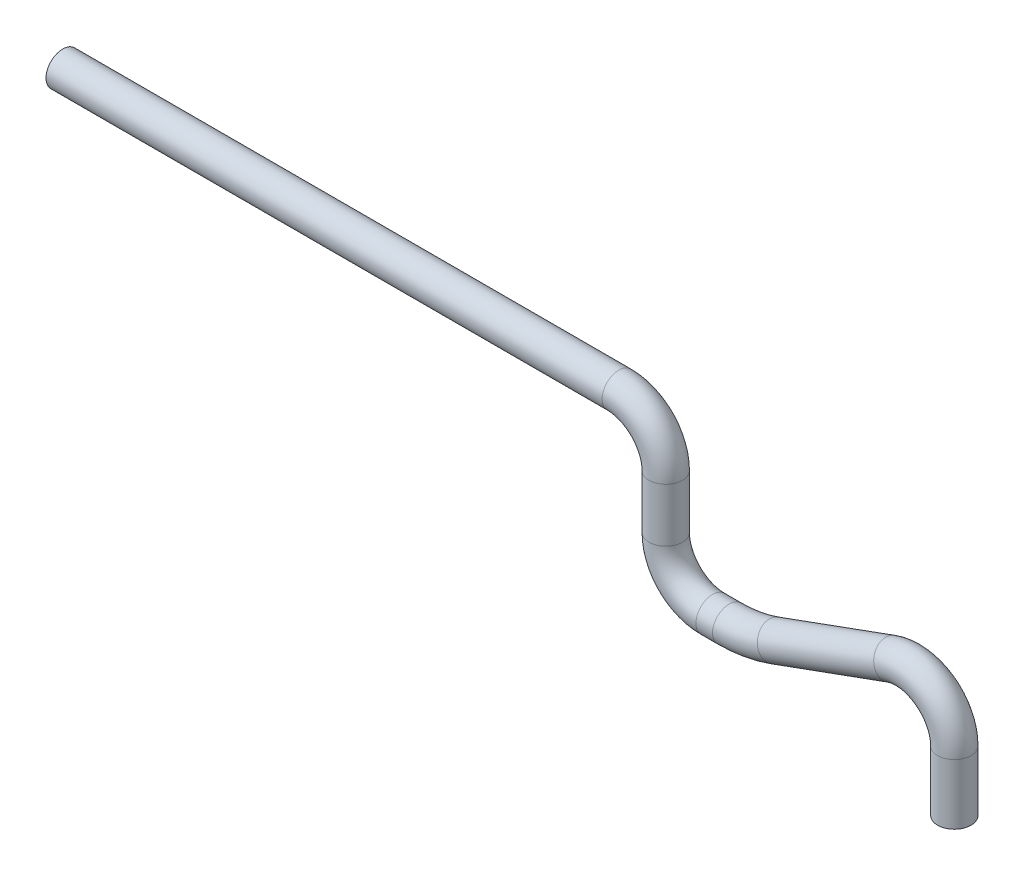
ISO-10303-21;
HEADER;
FILE_DESCRIPTION(('STEP AP214'),'2;1');
FILE_NAME('part.step','',(''),(''),'','','');
FILE_SCHEMA(('AUTOMOTIVE_DESIGN { 1 0 10303 214 1 1 1 1 }'));
ENDSEC;
DATA;
#1=APPLICATION_CONTEXT('core data for automotive mechanical design processes');
#2=APPLICATION_PROTOCOL_DEFINITION('international standard','automotive_design',2000,#1);
#3=PRODUCT_CONTEXT('',#1,'mechanical');
#4=PRODUCT('Part','Part','',(#3));
#5=PRODUCT_RELATED_PRODUCT_CATEGORY('part','',(#4));
#6=PRODUCT_DEFINITION_FORMATION('','',#4);
#7=PRODUCT_DEFINITION_CONTEXT('part definition',#1,'design');
#8=PRODUCT_DEFINITION('design','',#6,#7);
#9=PRODUCT_DEFINITION_SHAPE('','',#8);
#10=(LENGTH_UNIT() NAMED_UNIT(*) SI_UNIT(.MILLI.,.METRE.));
#11=(NAMED_UNIT(*) PLANE_ANGLE_UNIT() SI_UNIT($,.RADIAN.));
#12=(NAMED_UNIT(*) SI_UNIT($,.STERADIAN.) SOLID_ANGLE_UNIT());
#13=UNCERTAINTY_MEASURE_WITH_UNIT(LENGTH_MEASURE(1.E-05),#10,'distance_accuracy_value','');
#14=(GEOMETRIC_REPRESENTATION_CONTEXT(3) GLOBAL_UNCERTAINTY_ASSIGNED_CONTEXT((#13)) GLOBAL_UNIT_ASSIGNED_CONTEXT((#10,
#11,#12)) REPRESENTATION_CONTEXT('',''));
#15=CARTESIAN_POINT('',(0.,0.,0.));
#16=DIRECTION('',(0.,0.,1.));
#17=DIRECTION('',(1.,0.,0.));
#18=AXIS2_PLACEMENT_3D('',#15,#16,#17);
#19=CARTESIAN_POINT('',(43.0701638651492,-21.0523914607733,0.));
#20=DIRECTION('',(0.,-1.,0.));
#21=DIRECTION('',(1.,0.,0.));
#22=AXIS2_PLACEMENT_3D('',#19,#20,#21);
#23=CYLINDRICAL_SURFACE('',#22,2.5);
#24=CARTESIAN_POINT('',(43.0701638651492,-21.0523914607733,0.));
#25=DIRECTION('',(0.,-1.,0.));
#26=DIRECTION('',(0.,0.,-1.));
#27=AXIS2_PLACEMENT_3D('',#24,#25,#26);
#28=CIRCLE('',#27,2.5);
#29=CARTESIAN_POINT('',(45.5701638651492,-21.0523914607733,0.));
#30=VERTEX_POINT('',#29);
#31=EDGE_CURVE('E32',#30,#30,#28,.T.);
#32=CARTESIAN_POINT('',(43.0701638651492,-30.0553554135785,0.));
#33=DIRECTION('',(0.,-1.,0.));
#34=DIRECTION('',(0.,0.,-1.));
#35=AXIS2_PLACEMENT_3D('',#32,#33,#34);
#36=CIRCLE('',#35,2.5);
#37=CARTESIAN_POINT('',(45.5701638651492,-30.0553554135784,0.));
#38=VERTEX_POINT('',#37);
#39=EDGE_CURVE('E10',#38,#38,#36,.T.);
#40=CARTESIAN_POINT('',(45.5701638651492,-21.0523914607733,0.));
#41=CARTESIAN_POINT('',(45.5701638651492,-21.1461723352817,0.));
#42=CARTESIAN_POINT('',(45.5701638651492,-21.2399532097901,0.));
#43=CARTESIAN_POINT('',(45.5701638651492,-21.4275149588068,0.));
#44=CARTESIAN_POINT('',(45.5701638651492,-21.5212958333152,0.));
#45=CARTESIAN_POINT('',(45.5701638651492,-21.708857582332,0.));
#46=CARTESIAN_POINT('',(45.5701638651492,-21.8026384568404,0.));
#47=CARTESIAN_POINT('',(45.5701638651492,-21.9902002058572,0.));
#48=CARTESIAN_POINT('',(45.5701638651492,-22.0839810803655,0.));
#49=CARTESIAN_POINT('',(45.5701638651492,-22.2715428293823,0.));
#50=CARTESIAN_POINT('',(45.5701638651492,-22.3653237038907,0.));
#51=CARTESIAN_POINT('',(45.5701638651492,-22.5528854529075,0.));
#52=CARTESIAN_POINT('',(45.5701638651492,-22.6466663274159,0.));
#53=CARTESIAN_POINT('',(45.5701638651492,-22.8342280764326,0.));
#54=CARTESIAN_POINT('',(45.5701638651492,-22.928008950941,0.));
#55=CARTESIAN_POINT('',(45.5701638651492,-23.1155706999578,0.));
#56=CARTESIAN_POINT('',(45.5701638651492,-23.2093515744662,0.));
#57=CARTESIAN_POINT('',(45.5701638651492,-23.396913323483,0.));
#58=CARTESIAN_POINT('',(45.5701638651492,-23.4906941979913,0.));
#59=CARTESIAN_POINT('',(45.5701638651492,-23.6782559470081,0.));
#60=CARTESIAN_POINT('',(45.5701638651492,-23.7720368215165,0.));
#61=CARTESIAN_POINT('',(45.5701638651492,-23.9595985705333,0.));
#62=CARTESIAN_POINT('',(45.5701638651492,-24.0533794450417,0.));
#63=CARTESIAN_POINT('',(45.5701638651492,-24.2409411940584,0.));
#64=CARTESIAN_POINT('',(45.5701638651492,-24.3347220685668,0.));
#65=CARTESIAN_POINT('',(45.5701638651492,-24.5222838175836,0.));
#66=CARTESIAN_POINT('',(45.5701638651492,-24.616064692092,0.));
#67=CARTESIAN_POINT('',(45.5701638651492,-24.8036264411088,0.));
#68=CARTESIAN_POINT('',(45.5701638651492,-24.8974073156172,0.));
#69=CARTESIAN_POINT('',(45.5701638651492,-25.0849690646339,0.));
#70=CARTESIAN_POINT('',(45.5701638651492,-25.1787499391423,0.));
#71=CARTESIAN_POINT('',(45.5701638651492,-25.3663116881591,0.));
#72=CARTESIAN_POINT('',(45.5701638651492,-25.4600925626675,0.));
#73=CARTESIAN_POINT('',(45.5701638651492,-25.6476543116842,0.));
#74=CARTESIAN_POINT('',(45.5701638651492,-25.7414351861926,0.));
#75=CARTESIAN_POINT('',(45.5701638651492,-25.9289969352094,0.));
#76=CARTESIAN_POINT('',(45.5701638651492,-26.0227778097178,0.));
#77=CARTESIAN_POINT('',(45.5701638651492,-26.2103395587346,0.));
#78=CARTESIAN_POINT('',(45.5701638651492,-26.304120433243,0.));
#79=CARTESIAN_POINT('',(45.5701638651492,-26.4916821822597,0.));
#80=CARTESIAN_POINT('',(45.5701638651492,-26.5854630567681,0.));
#81=CARTESIAN_POINT('',(45.5701638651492,-26.7730248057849,0.));
#82=CARTESIAN_POINT('',(45.5701638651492,-26.8668056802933,0.));
#83=CARTESIAN_POINT('',(45.5701638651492,-27.0543674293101,0.));
#84=CARTESIAN_POINT('',(45.5701638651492,-27.1481483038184,0.));
#85=CARTESIAN_POINT('',(45.5701638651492,-27.3357100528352,0.));
#86=CARTESIAN_POINT('',(45.5701638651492,-27.4294909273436,0.));
#87=CARTESIAN_POINT('',(45.5701638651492,-27.6170526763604,0.));
#88=CARTESIAN_POINT('',(45.5701638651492,-27.7108335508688,0.));
#89=CARTESIAN_POINT('',(45.5701638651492,-27.8983952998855,0.));
#90=CARTESIAN_POINT('',(45.5701638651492,-27.9921761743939,0.));
#91=CARTESIAN_POINT('',(45.5701638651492,-28.1797379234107,0.));
#92=CARTESIAN_POINT('',(45.5701638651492,-28.2735187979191,0.));
#93=CARTESIAN_POINT('',(45.5701638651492,-28.4610805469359,0.));
#94=CARTESIAN_POINT('',(45.5701638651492,-28.5548614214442,0.));
#95=CARTESIAN_POINT('',(45.5701638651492,-28.742423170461,0.));
#96=CARTESIAN_POINT('',(45.5701638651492,-28.8362040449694,0.));
#97=CARTESIAN_POINT('',(45.5701638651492,-29.0237657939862,0.));
#98=CARTESIAN_POINT('',(45.5701638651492,-29.1175466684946,0.));
#99=CARTESIAN_POINT('',(45.5701638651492,-29.3051084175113,0.));
#100=CARTESIAN_POINT('',(45.5701638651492,-29.3988892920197,0.));
#101=CARTESIAN_POINT('',(45.5701638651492,-29.5864510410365,0.));
#102=CARTESIAN_POINT('',(45.5701638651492,-29.6802319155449,0.));
#103=CARTESIAN_POINT('',(45.5701638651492,-29.8677936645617,0.));
#104=CARTESIAN_POINT('',(45.5701638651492,-29.96157453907,0.));
#105=CARTESIAN_POINT('',(45.5701638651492,-30.0553554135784,0.));
#106=B_SPLINE_CURVE_WITH_KNOTS('',3,(#40,#41,#42,#43,#44,#45,#46,#47,#48,#49,#50,#51,#52,#53,
#54,#55,#56,#57,#58,#59,#60,#61,#62,#63,#64,#65,#66,#67,#68,#69,#70,#71,#72,#73,#74,#75,#76,#77,
#78,#79,#80,#81,#82,#83,#84,#85,#86,#87,#88,#89,#90,#91,#92,#93,#94,#95,#96,#97,#98,#99,#100,
#101,#102,#103,#104,#105),.UNSPECIFIED.,.F.,.F.,(4,2,2,2,2,2,2,2,2,2,2,2,2,2,2,2,2,2,2,2,2,2,2,
2,2,2,2,2,2,2,2,2,4),(0.,0.281342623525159,0.562685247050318,0.84402787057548,1.12537049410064,
1.4067131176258,1.68805574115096,1.96939836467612,2.25074098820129,2.53208361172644,
2.8134262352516,3.09476885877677,3.37611148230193,3.65745410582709,3.93879672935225,
4.22013935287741,4.50148197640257,4.78282459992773,5.06416722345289,5.34550984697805,
5.62685247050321,5.90819509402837,6.18953771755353,6.4708803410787,6.75222296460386,
7.03356558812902,7.31490821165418,7.59625083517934,7.8775934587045,8.15893608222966,
8.44027870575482,8.72162132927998,9.00296395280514),.UNSPECIFIED.);
#107=EDGE_CURVE('BSEAM26',#30,#38,#106,.T.);
#108=ORIENTED_EDGE('',*,*,#31,.T.);
#109=ORIENTED_EDGE('',*,*,#39,.F.);
#110=ORIENTED_EDGE('',*,*,#107,.T.);
#111=ORIENTED_EDGE('',*,*,#107,.F.);
#112=EDGE_LOOP('',(#108,#110,#109,#111));
#113=FACE_BOUND('',#112,.T.);
#114=ADVANCED_FACE('F26',(#113),#23,.T.);
#115=CARTESIAN_POINT('',(36.0701638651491,-21.0523914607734,0.));
#116=DIRECTION('',(0.,0.,-1.));
#117=DIRECTION('',(-1.,0.,0.));
#118=AXIS2_PLACEMENT_3D('',#115,#116,#117);
#119=TOROIDAL_SURFACE('',#118,7.00000000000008,2.5);
#120=CARTESIAN_POINT('',(33.6760228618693,-14.474543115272,0.));
#121=DIRECTION('',(0.939692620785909,0.342020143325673,0.));
#122=DIRECTION('',(0.,0.,-1.));
#123=AXIS2_PLACEMENT_3D('',#120,#121,#122);
#124=CIRCLE('',#123,2.5);
#125=CARTESIAN_POINT('',(32.8209725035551,-12.1253115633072,0.));
#126=VERTEX_POINT('',#125);
#127=EDGE_CURVE('E36',#126,#126,#124,.T.);
#128=CARTESIAN_POINT('',(36.0701638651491,-21.0523914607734,0.));
#129=DIRECTION('',(0.,0.,-1.));
#130=DIRECTION('',(-1.,0.,0.));
#131=AXIS2_PLACEMENT_3D('',#128,#129,#130);
#132=CIRCLE('',#131,9.50000000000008);
#133=EDGE_CURVE('',#126,#30,#132,.T.);
#134=ORIENTED_EDGE('',*,*,#127,.T.);
#135=ORIENTED_EDGE('',*,*,#31,.F.);
#136=ORIENTED_EDGE('',*,*,#133,.T.);
#137=ORIENTED_EDGE('',*,*,#133,.F.);
#138=EDGE_LOOP('',(#134,#136,#135,#137));
#139=FACE_BOUND('',#138,.T.);
#140=ADVANCED_FACE('F84',(#139),#119,.T.);
#141=CARTESIAN_POINT('',(16.3138632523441,-20.7938524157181,0.));
#142=DIRECTION('',(0.939692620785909,0.342020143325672,0.));
#143=DIRECTION('',(-0.342020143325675,0.939692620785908,0.));
#144=AXIS2_PLACEMENT_3D('',#141,#142,#143);
#145=CYLINDRICAL_SURFACE('',#144,2.5);
#146=CARTESIAN_POINT('',(16.3138632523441,-20.7938524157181,0.));
#147=DIRECTION('',(0.939692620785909,0.342020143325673,0.));
#148=DIRECTION('',(0.,0.,-1.));
#149=AXIS2_PLACEMENT_3D('',#146,#147,#148);
#150=CIRCLE('',#149,2.5);
#151=CARTESIAN_POINT('',(17.1689136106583,-23.1430839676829,0.));
#152=VERTEX_POINT('',#151);
#153=EDGE_CURVE('E40',#152,#152,#150,.T.);
#154=ORIENTED_EDGE('',*,*,#153,.T.);
#155=EDGE_LOOP('',(#154));
#156=FACE_BOUND('',#155,.T.);
#157=ORIENTED_EDGE('',*,*,#127,.F.);
#158=EDGE_LOOP('',(#157));
#159=FACE_BOUND('',#158,.T.);
#160=ADVANCED_FACE('F88',(#156,#159),#145,.T.);
#161=CARTESIAN_POINT('',(9.47346038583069,-2.,0.));
#162=DIRECTION('',(0.,0.,1.));
#163=DIRECTION('',(1.,0.,0.));
#164=AXIS2_PLACEMENT_3D('',#161,#162,#163);
#165=TOROIDAL_SURFACE('',#164,20.,2.5);
#166=CARTESIAN_POINT('',(9.47346038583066,-22.,0.));
#167=DIRECTION('',(1.,0.,0.));
#168=DIRECTION('',(0.,0.,-1.));
#169=AXIS2_PLACEMENT_3D('',#166,#167,#168);
#170=CIRCLE('',#169,2.5);
#171=CARTESIAN_POINT('',(9.47346038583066,-24.5,0.));
#172=VERTEX_POINT('',#171);
#173=EDGE_CURVE('E45',#172,#172,#170,.T.);
#174=CARTESIAN_POINT('',(9.47346038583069,-2.,0.));
#175=DIRECTION('',(0.,0.,1.));
#176=DIRECTION('',(1.,0.,0.));
#177=AXIS2_PLACEMENT_3D('',#174,#175,#176);
#178=CIRCLE('',#177,22.5);
#179=EDGE_CURVE('',#172,#152,#178,.T.);
#180=ORIENTED_EDGE('',*,*,#173,.T.);
#181=ORIENTED_EDGE('',*,*,#153,.F.);
#182=ORIENTED_EDGE('',*,*,#179,.T.);
#183=ORIENTED_EDGE('',*,*,#179,.F.);
#184=EDGE_LOOP('',(#180,#182,#181,#183));
#185=FACE_BOUND('',#184,.T.);
#186=ADVANCED_FACE('F94',(#185),#165,.T.);
#187=CARTESIAN_POINT('',(7.00000000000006,-22.,0.));
#188=DIRECTION('',(1.,0.,0.));
#189=DIRECTION('',(0.,0.,-1.));
#190=AXIS2_PLACEMENT_3D('',#187,#188,#189);
#191=CYLINDRICAL_SURFACE('',#190,2.5);
#192=CARTESIAN_POINT('',(7.00000000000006,-22.,0.));
#193=DIRECTION('',(1.,0.,0.));
#194=DIRECTION('',(0.,0.,-1.));
#195=AXIS2_PLACEMENT_3D('',#192,#193,#194);
#196=CIRCLE('',#195,2.5);
#197=CARTESIAN_POINT('',(7.00000000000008,-24.5,0.));
#198=VERTEX_POINT('',#197);
#199=EDGE_CURVE('E48',#198,#198,#196,.T.);
#200=ORIENTED_EDGE('',*,*,#199,.T.);
#201=EDGE_LOOP('',(#200));
#202=FACE_BOUND('',#201,.T.);
#203=ORIENTED_EDGE('',*,*,#173,.F.);
#204=EDGE_LOOP('',(#203));
#205=FACE_BOUND('',#204,.T.);
#206=ADVANCED_FACE('F101',(#202,#205),#191,.T.);
#207=CARTESIAN_POINT('',(7.00000000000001,-15.,0.));
#208=DIRECTION('',(0.,0.,1.));
#209=DIRECTION('',(1.,0.,0.));
#210=AXIS2_PLACEMENT_3D('',#207,#208,#209);
#211=TOROIDAL_SURFACE('',#210,7.,2.5);
#212=CARTESIAN_POINT('',(0.,-15.,0.));
#213=DIRECTION('',(0.,-1.,0.));
#214=DIRECTION('',(0.,0.,-1.));
#215=AXIS2_PLACEMENT_3D('',#212,#213,#214);
#216=CIRCLE('',#215,2.5);
#217=CARTESIAN_POINT('',(-2.49999999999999,-14.9999999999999,0.));
#218=VERTEX_POINT('',#217);
#219=EDGE_CURVE('E51',#218,#218,#216,.T.);
#220=CARTESIAN_POINT('',(7.00000000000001,-15.,0.));
#221=DIRECTION('',(0.,0.,1.));
#222=DIRECTION('',(1.,0.,0.));
#223=AXIS2_PLACEMENT_3D('',#220,#221,#222);
#224=CIRCLE('',#223,9.5);
#225=EDGE_CURVE('',#218,#198,#224,.T.);
#226=ORIENTED_EDGE('',*,*,#219,.T.);
#227=ORIENTED_EDGE('',*,*,#199,.F.);
#228=ORIENTED_EDGE('',*,*,#225,.T.);
#229=ORIENTED_EDGE('',*,*,#225,.F.);
#230=EDGE_LOOP('',(#226,#228,#227,#229));
#231=FACE_BOUND('',#230,.T.);
#232=ADVANCED_FACE('F105',(#231),#211,.T.);
#233=CARTESIAN_POINT('',(0.,-7.00000000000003,0.));
#234=DIRECTION('',(0.,-1.,0.));
#235=DIRECTION('',(1.,0.,0.));
#236=AXIS2_PLACEMENT_3D('',#233,#234,#235);
#237=CYLINDRICAL_SURFACE('',#236,2.5);
#238=CARTESIAN_POINT('',(0.,-7.00000000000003,0.));
#239=DIRECTION('',(0.,-1.,0.));
#240=DIRECTION('',(0.,0.,-1.));
#241=AXIS2_PLACEMENT_3D('',#238,#239,#240);
#242=CIRCLE('',#241,2.5);
#243=CARTESIAN_POINT('',(2.49999999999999,-7.00000000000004,0.));
#244=VERTEX_POINT('',#243);
#245=EDGE_CURVE('E54',#244,#244,#242,.T.);
#246=ORIENTED_EDGE('',*,*,#245,.T.);
#247=EDGE_LOOP('',(#246));
#248=FACE_BOUND('',#247,.T.);
#249=ORIENTED_EDGE('',*,*,#219,.F.);
#250=EDGE_LOOP('',(#249));
#251=FACE_BOUND('',#250,.T.);
#252=ADVANCED_FACE('F79',(#248,#251),#237,.T.);
#253=CARTESIAN_POINT('',(-7.00000000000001,-7.00000000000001,0.));
#254=DIRECTION('',(0.,0.,-1.));
#255=DIRECTION('',(-1.,0.,0.));
#256=AXIS2_PLACEMENT_3D('',#253,#254,#255);
#257=TOROIDAL_SURFACE('',#256,7.,2.5);
#258=CARTESIAN_POINT('',(-7.00000000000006,0.,0.));
#259=DIRECTION('',(1.,0.,0.));
#260=DIRECTION('',(0.,0.,-1.));
#261=AXIS2_PLACEMENT_3D('',#258,#259,#260);
#262=CIRCLE('',#261,2.5);
#263=CARTESIAN_POINT('',(-7.00000000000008,2.49999999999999,0.));
#264=VERTEX_POINT('',#263);
#265=EDGE_CURVE('E57',#264,#264,#262,.T.);
#266=CARTESIAN_POINT('',(-7.00000000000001,-7.00000000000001,0.));
#267=DIRECTION('',(0.,0.,-1.));
#268=DIRECTION('',(-1.,0.,0.));
#269=AXIS2_PLACEMENT_3D('',#266,#267,#268);
#270=CIRCLE('',#269,9.5);
#271=EDGE_CURVE('',#264,#244,#270,.T.);
#272=ORIENTED_EDGE('',*,*,#265,.T.);
#273=ORIENTED_EDGE('',*,*,#245,.F.);
#274=ORIENTED_EDGE('',*,*,#271,.T.);
#275=ORIENTED_EDGE('',*,*,#271,.F.);
#276=EDGE_LOOP('',(#272,#274,#273,#275));
#277=FACE_BOUND('',#276,.T.);
#278=ADVANCED_FACE('F69',(#277),#257,.T.);
#279=CARTESIAN_POINT('',(-7.00000000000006,0.,0.));
#280=DIRECTION('',(-1.,0.,0.));
#281=DIRECTION('',(0.,0.,1.));
#282=AXIS2_PLACEMENT_3D('',#279,#280,#281);
#283=CYLINDRICAL_SURFACE('',#282,2.5);
#284=ORIENTED_EDGE('',*,*,#265,.F.);
#285=EDGE_LOOP('',(#284));
#286=FACE_BOUND('',#285,.T.);
#287=CARTESIAN_POINT('',(-90.0000000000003,1.66533453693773E-13,7.7715611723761E-13));
#288=DIRECTION('',(-1.,0.,0.));
#289=DIRECTION('',(0.,0.,1.));
#290=AXIS2_PLACEMENT_3D('',#287,#288,#289);
#291=CIRCLE('',#290,2.5);
#292=CARTESIAN_POINT('',(-90.0000000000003,1.66465863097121E-13,2.50000000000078));
#293=VERTEX_POINT('',#292);
#294=EDGE_CURVE('E60',#293,#293,#291,.T.);
#295=ORIENTED_EDGE('',*,*,#294,.F.);
#296=EDGE_LOOP('',(#295));
#297=FACE_BOUND('',#296,.T.);
#298=ADVANCED_FACE('F66',(#286,#297),#283,.T.);
#299=CARTESIAN_POINT('',(43.0701638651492,-30.0553554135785,0.));
#300=DIRECTION('',(0.,-1.,0.));
#301=DIRECTION('',(0.,0.,-1.));
#302=AXIS2_PLACEMENT_3D('',#299,#300,#301);
#303=PLANE('',#302);
#304=ORIENTED_EDGE('',*,*,#39,.T.);
#305=EDGE_LOOP('',(#304));
#306=FACE_BOUND('',#305,.T.);
#307=ADVANCED_FACE('F68',(#306),#303,.T.);
#308=CARTESIAN_POINT('',(-90.0000000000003,1.66533453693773E-13,7.7715611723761E-13));
#309=DIRECTION('',(-1.,0.,0.));
#310=DIRECTION('',(0.,0.,1.));
#311=AXIS2_PLACEMENT_3D('',#308,#309,#310);
#312=PLANE('',#311);
#313=ORIENTED_EDGE('',*,*,#294,.T.);
#314=EDGE_LOOP('',(#313));
#315=FACE_BOUND('',#314,.T.);
#316=ADVANCED_FACE('F64',(#315),#312,.T.);
#317=CLOSED_SHELL('',(#114,#140,#160,#186,#206,#232,#252,#278,#298,#307,#316));
#318=MANIFOLD_SOLID_BREP('B2',#317);
#319=ADVANCED_BREP_SHAPE_REPRESENTATION('',(#18,#318),#14);
#320=SHAPE_DEFINITION_REPRESENTATION(#9,#319);
ENDSEC;
END-ISO-10303-21;
